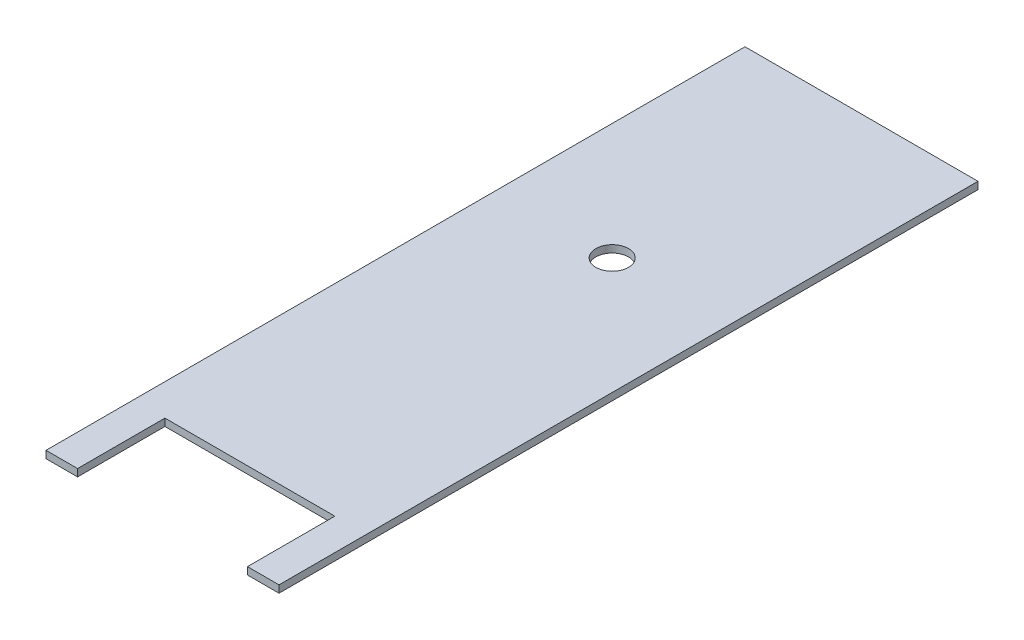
from build123d import *

# Parameters (mm, degrees)
SKETCH1_W           = 152.4
SKETCH1_H           = 457.2
BOSS_EXTRUDE1_DEPTH = 4.7625
SKETCH2_R           = 10.668
SKETCH2_W           = 111.125
SKETCH2_H           = 57.15
CUT_EXTRUDE1_DEPTH  = 242.012616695


with BuildPart() as part:
    # Sketch1 → Boss-Extrude1 (new body)
    with BuildSketch(Plane(origin=(0, 0, 0), x_dir=(1, 0, 0), z_dir=(0, 1, 0))):
        Rectangle(SKETCH1_W, SKETCH1_H)
    extrude(amount=BOSS_EXTRUDE1_DEPTH)

    # Sketch2 → Cut-Extrude1 (cut, through all)
    with BuildSketch(Plane(origin=(0, 4.7625, 0), x_dir=(1, 0, 0), z_dir=(0, 1, 0))):
        with Locations(Location((0, 65.532, 0), (0, 0, 270))):
            Circle(SKETCH2_R)
        with Locations((0, -200.025)):
            Rectangle(SKETCH2_W, SKETCH2_H)
    extrude(amount=-CUT_EXTRUDE1_DEPTH, mode=Mode.SUBTRACT)


solid = part.part
